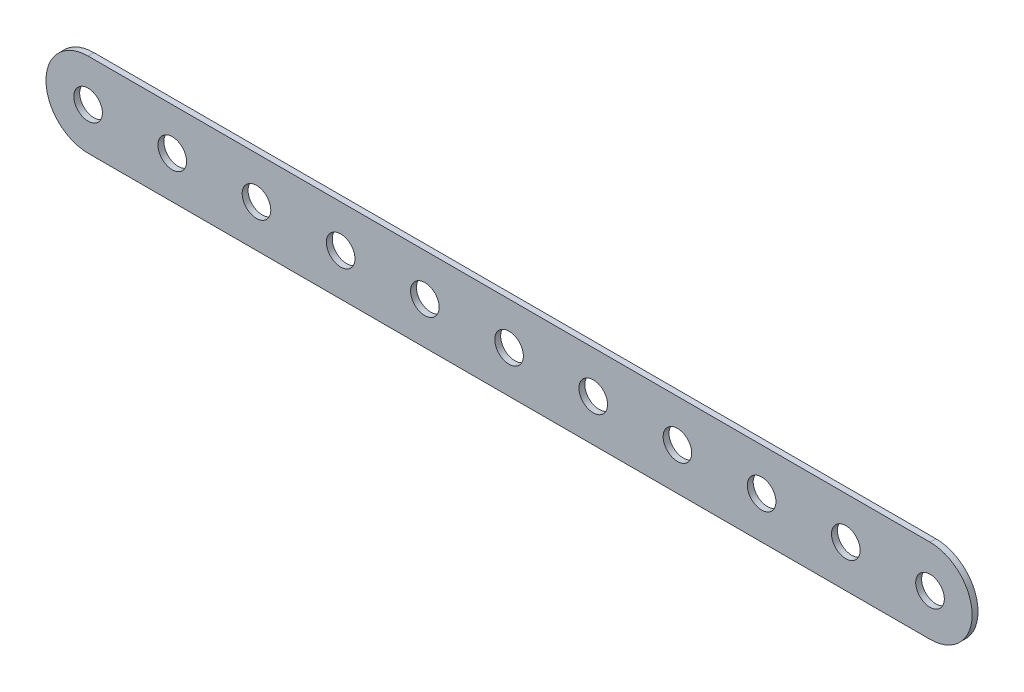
from build123d import *

# Parameters (mm, degrees)
BOSS_EXTRUDE1_DEPTH = 0.889
SKETCH2_R           = 2.159
CUT_EXTRUDE1_DEPTH  = 71.143676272


with BuildPart() as part:
    # Sketch1 → Boss-Extrude1 (new body)
    with BuildSketch(Plane.XY):
        with BuildLine():
            Line((-63.5, 6.35), (63.5, 6.35))
            ThreePointArc((63.5, 6.35), (69.85, 0), (63.5, -6.35))
            Line((63.5, -6.35), (-63.5, -6.35))
            ThreePointArc((-63.5, -6.35), (-69.85, 0), (-63.5, 6.35))
        make_face()
    extrude(amount=BOSS_EXTRUDE1_DEPTH)

    # Sketch2 → Cut-Extrude1 (cut, through all)
    with BuildSketch(Plane.XY.offset(0.889)):
        with Locations((-63.5, 0)):
            Circle(SKETCH2_R)
        with Locations((-50.8, 0)):
            Circle(SKETCH2_R)
        with Locations((-38.1, 0)):
            Circle(SKETCH2_R)
        with Locations((-25.4, 0)):
            Circle(SKETCH2_R)
        with Locations((-12.7, 0)):
            Circle(SKETCH2_R)
        Circle(SKETCH2_R)
        with Locations((12.7, 0)):
            Circle(SKETCH2_R)
        with Locations((25.4, 0)):
            Circle(SKETCH2_R)
        with Locations((38.1, 0)):
            Circle(SKETCH2_R)
        with Locations((50.8, 0)):
            Circle(SKETCH2_R)
        with Locations((63.5, 0)):
            Circle(SKETCH2_R)
    extrude(amount=-CUT_EXTRUDE1_DEPTH, mode=Mode.SUBTRACT)


solid = part.part
